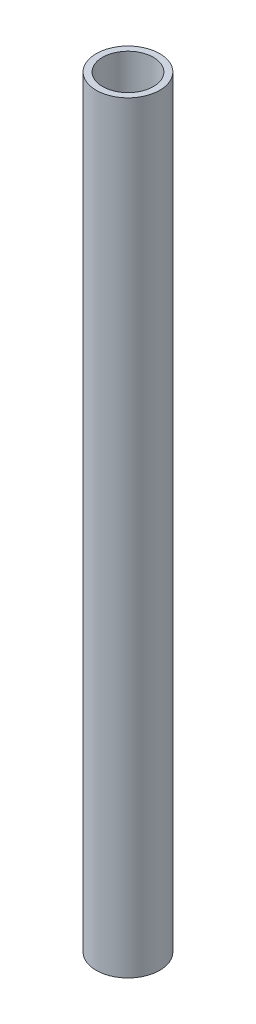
from build123d import *

# Parameters (mm, degrees)
SKETCH_1_R      = 5
SKETCH_1_R_2    = 4
EXTRUDE_1_DEPTH = 120


with BuildPart() as part:
    # Sketch 1 → Extrude 1 (new body)
    with BuildSketch(Plane(origin=(0, 0, 0), x_dir=(1, 0, 0), z_dir=(0, 1, 0))):
        with Locations(Location((0, 0, 0), (0, 0, 270))):
            Circle(SKETCH_1_R)
        with Locations(Location((0, 0, 0), (0, 0, 270))):
            Circle(SKETCH_1_R_2, mode=Mode.SUBTRACT)
    extrude(amount=EXTRUDE_1_DEPTH)


solid = part.part
